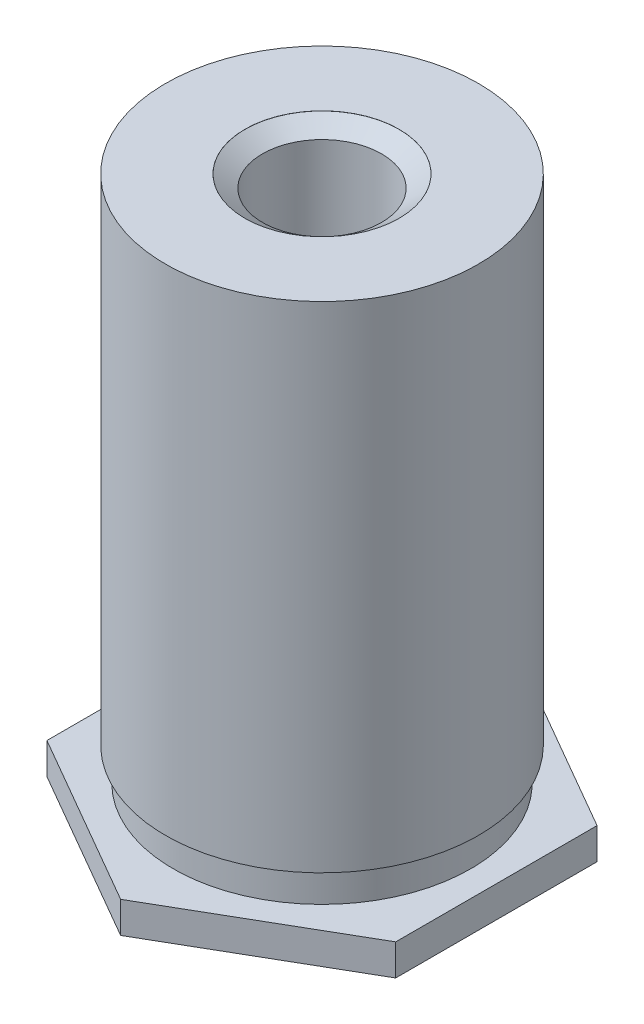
ISO-10303-21;
HEADER;
FILE_DESCRIPTION(('STEP AP214'),'2;1');
FILE_NAME('part.step','',(''),(''),'','','');
FILE_SCHEMA(('AUTOMOTIVE_DESIGN { 1 0 10303 214 1 1 1 1 }'));
ENDSEC;
DATA;
#1=APPLICATION_CONTEXT('core data for automotive mechanical design processes');
#2=APPLICATION_PROTOCOL_DEFINITION('international standard','automotive_design',2000,#1);
#3=PRODUCT_CONTEXT('',#1,'mechanical');
#4=PRODUCT('Part','Part','',(#3));
#5=PRODUCT_RELATED_PRODUCT_CATEGORY('part','',(#4));
#6=PRODUCT_DEFINITION_FORMATION('','',#4);
#7=PRODUCT_DEFINITION_CONTEXT('part definition',#1,'design');
#8=PRODUCT_DEFINITION('design','',#6,#7);
#9=PRODUCT_DEFINITION_SHAPE('','',#8);
#10=(LENGTH_UNIT() NAMED_UNIT(*) SI_UNIT(.MILLI.,.METRE.));
#11=(NAMED_UNIT(*) PLANE_ANGLE_UNIT() SI_UNIT($,.RADIAN.));
#12=(NAMED_UNIT(*) SI_UNIT($,.STERADIAN.) SOLID_ANGLE_UNIT());
#13=UNCERTAINTY_MEASURE_WITH_UNIT(LENGTH_MEASURE(1.E-05),#10,'distance_accuracy_value','');
#14=(GEOMETRIC_REPRESENTATION_CONTEXT(3) GLOBAL_UNCERTAINTY_ASSIGNED_CONTEXT((#13)) GLOBAL_UNIT_ASSIGNED_CONTEXT((#10,
#11,#12)) REPRESENTATION_CONTEXT('',''));
#15=CARTESIAN_POINT('',(0.,0.,0.));
#16=DIRECTION('',(0.,0.,1.));
#17=DIRECTION('',(1.,0.,0.));
#18=AXIS2_PLACEMENT_3D('',#15,#16,#17);
#19=CARTESIAN_POINT('',(4.596384,0.7112,0.));
#20=DIRECTION('',(0.,1.,0.));
#21=DIRECTION('',(0.,0.,1.));
#22=AXIS2_PLACEMENT_3D('',#19,#20,#21);
#23=PLANE('',#22);
#24=CARTESIAN_POINT('',(0.,0.7112,0.));
#25=DIRECTION('',(0.,-1.,0.));
#26=DIRECTION('',(0.,0.,-1.));
#27=AXIS2_PLACEMENT_3D('',#24,#25,#26);
#28=CIRCLE('',#27,3.3782);
#29=CARTESIAN_POINT('',(0.,0.7112,-3.3782));
#30=VERTEX_POINT('',#29);
#31=EDGE_CURVE('E11',#30,#30,#28,.T.);
#32=ORIENTED_EDGE('',*,*,#31,.T.);
#33=EDGE_LOOP('',(#32));
#34=FACE_BOUND('',#33,.T.);
#35=DIRECTION('',(0.866025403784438,0.,0.5));
#36=VECTOR('',#35,1.);
#37=CARTESIAN_POINT('',(0.,0.7112,4.57538541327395));
#38=LINE('',#37,#36);
#39=CARTESIAN_POINT('',(-3.9624,0.7112,2.28769270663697));
#40=VERTEX_POINT('',#39);
#41=CARTESIAN_POINT('',(0.,0.7112,4.57538541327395));
#42=VERTEX_POINT('',#41);
#43=EDGE_CURVE('E130',#40,#42,#38,.T.);
#44=ORIENTED_EDGE('',*,*,#43,.T.);
#45=DIRECTION('',(0.866025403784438,0.,-0.5));
#46=VECTOR('',#45,1.);
#47=CARTESIAN_POINT('',(3.9624,0.7112,2.28769270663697));
#48=LINE('',#47,#46);
#49=CARTESIAN_POINT('',(3.9624,0.7112,2.28769270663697));
#50=VERTEX_POINT('',#49);
#51=EDGE_CURVE('E119',#42,#50,#48,.T.);
#52=ORIENTED_EDGE('',*,*,#51,.T.);
#53=DIRECTION('',(0.,0.,-1.));
#54=VECTOR('',#53,1.);
#55=CARTESIAN_POINT('',(3.9624,0.7112,-2.28769270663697));
#56=LINE('',#55,#54);
#57=CARTESIAN_POINT('',(3.9624,0.7112,-2.28769270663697));
#58=VERTEX_POINT('',#57);
#59=EDGE_CURVE('E122',#50,#58,#56,.T.);
#60=ORIENTED_EDGE('',*,*,#59,.T.);
#61=DIRECTION('',(-0.866025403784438,0.,-0.5));
#62=VECTOR('',#61,1.);
#63=CARTESIAN_POINT('',(0.,0.7112,-4.57538541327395));
#64=LINE('',#63,#62);
#65=CARTESIAN_POINT('',(0.,0.7112,-4.57538541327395));
#66=VERTEX_POINT('',#65);
#67=EDGE_CURVE('E47',#58,#66,#64,.T.);
#68=ORIENTED_EDGE('',*,*,#67,.T.);
#69=DIRECTION('',(-0.866025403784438,0.,0.5));
#70=VECTOR('',#69,1.);
#71=CARTESIAN_POINT('',(-3.9624,0.7112,-2.28769270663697));
#72=LINE('',#71,#70);
#73=CARTESIAN_POINT('',(-3.9624,0.7112,-2.28769270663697));
#74=VERTEX_POINT('',#73);
#75=EDGE_CURVE('E95',#66,#74,#72,.T.);
#76=ORIENTED_EDGE('',*,*,#75,.T.);
#77=DIRECTION('',(0.,0.,1.));
#78=VECTOR('',#77,1.);
#79=CARTESIAN_POINT('',(-3.9624,0.7112,2.28769270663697));
#80=LINE('',#79,#78);
#81=EDGE_CURVE('E127',#74,#40,#80,.T.);
#82=ORIENTED_EDGE('',*,*,#81,.T.);
#83=EDGE_LOOP('',(#44,#52,#60,#68,#76,#82));
#84=FACE_BOUND('',#83,.T.);
#85=ADVANCED_FACE('F32',(#34,#84),#23,.T.);
#86=CARTESIAN_POINT('',(0.,0.,0.));
#87=DIRECTION('',(0.,-1.,0.));
#88=DIRECTION('',(0.,0.,-1.));
#89=AXIS2_PLACEMENT_3D('',#86,#87,#88);
#90=CYLINDRICAL_SURFACE('',#89,3.3782);
#91=CARTESIAN_POINT('',(0.,1.45796,0.));
#92=DIRECTION('',(0.,-1.,0.));
#93=DIRECTION('',(0.,0.,-1.));
#94=AXIS2_PLACEMENT_3D('',#91,#92,#93);
#95=CIRCLE('',#94,3.3782);
#96=CARTESIAN_POINT('',(0.,1.45796,-3.3782));
#97=VERTEX_POINT('',#96);
#98=EDGE_CURVE('E40',#97,#97,#95,.T.);
#99=ORIENTED_EDGE('',*,*,#98,.T.);
#100=EDGE_LOOP('',(#99));
#101=FACE_BOUND('',#100,.T.);
#102=ORIENTED_EDGE('',*,*,#31,.F.);
#103=EDGE_LOOP('',(#102));
#104=FACE_BOUND('',#103,.T.);
#105=ADVANCED_FACE('F164',(#101,#104),#90,.T.);
#106=CARTESIAN_POINT('',(3.556,1.45796,0.));
#107=DIRECTION('',(0.,-1.,0.));
#108=DIRECTION('',(0.,0.,-1.));
#109=AXIS2_PLACEMENT_3D('',#106,#107,#108);
#110=PLANE('',#109);
#111=CARTESIAN_POINT('',(0.,1.45796,0.));
#112=DIRECTION('',(0.,-1.,0.));
#113=DIRECTION('',(0.,0.,-1.));
#114=AXIS2_PLACEMENT_3D('',#111,#112,#113);
#115=CIRCLE('',#114,3.556);
#116=CARTESIAN_POINT('',(0.,1.45796,-3.556));
#117=VERTEX_POINT('',#116);
#118=EDGE_CURVE('E158',#117,#117,#115,.T.);
#119=ORIENTED_EDGE('',*,*,#118,.T.);
#120=EDGE_LOOP('',(#119));
#121=FACE_BOUND('',#120,.T.);
#122=ORIENTED_EDGE('',*,*,#98,.F.);
#123=EDGE_LOOP('',(#122));
#124=FACE_BOUND('',#123,.T.);
#125=ADVANCED_FACE('F167',(#121,#124),#110,.T.);
#126=CARTESIAN_POINT('',(0.,0.,0.));
#127=DIRECTION('',(0.,-1.,0.));
#128=DIRECTION('',(0.,0.,-1.));
#129=AXIS2_PLACEMENT_3D('',#126,#127,#128);
#130=CYLINDRICAL_SURFACE('',#129,3.556);
#131=CARTESIAN_POINT('',(0.,12.7,0.));
#132=DIRECTION('',(0.,-1.,0.));
#133=DIRECTION('',(0.,0.,-1.));
#134=AXIS2_PLACEMENT_3D('',#131,#132,#133);
#135=CIRCLE('',#134,3.556);
#136=CARTESIAN_POINT('',(0.,12.7,-3.556));
#137=VERTEX_POINT('',#136);
#138=EDGE_CURVE('E155',#137,#137,#135,.T.);
#139=ORIENTED_EDGE('',*,*,#138,.T.);
#140=EDGE_LOOP('',(#139));
#141=FACE_BOUND('',#140,.T.);
#142=ORIENTED_EDGE('',*,*,#118,.F.);
#143=EDGE_LOOP('',(#142));
#144=FACE_BOUND('',#143,.T.);
#145=ADVANCED_FACE('F169',(#141,#144),#130,.T.);
#146=CARTESIAN_POINT('',(3.556,12.7,0.));
#147=DIRECTION('',(0.,1.,0.));
#148=DIRECTION('',(0.,0.,1.));
#149=AXIS2_PLACEMENT_3D('',#146,#147,#148);
#150=PLANE('',#149);
#151=CARTESIAN_POINT('',(0.,12.7,0.));
#152=DIRECTION('',(0.,1.,0.));
#153=DIRECTION('',(0.,0.,1.));
#154=AXIS2_PLACEMENT_3D('',#151,#152,#153);
#155=CIRCLE('',#154,1.7526);
#156=CARTESIAN_POINT('',(0.,12.7,1.7526));
#157=VERTEX_POINT('',#156);
#158=EDGE_CURVE('E35',#157,#157,#155,.T.);
#159=ORIENTED_EDGE('',*,*,#158,.F.);
#160=EDGE_LOOP('',(#159));
#161=FACE_BOUND('',#160,.T.);
#162=ORIENTED_EDGE('',*,*,#138,.F.);
#163=EDGE_LOOP('',(#162));
#164=FACE_BOUND('',#163,.T.);
#165=ADVANCED_FACE('F176',(#161,#164),#150,.T.);
#166=CARTESIAN_POINT('',(0.,-2.54,0.));
#167=DIRECTION('',(0.,-1.,0.));
#168=DIRECTION('',(0.,0.,-1.));
#169=AXIS2_PLACEMENT_3D('',#166,#167,#168);
#170=CYLINDRICAL_SURFACE('',#169,1.7526);
#171=ORIENTED_EDGE('',*,*,#158,.T.);
#172=EDGE_LOOP('',(#171));
#173=FACE_BOUND('',#172,.T.);
#174=CARTESIAN_POINT('',(0.,12.69746,0.));
#175=DIRECTION('',(0.,-1.,0.));
#176=DIRECTION('',(0.,0.,-1.));
#177=AXIS2_PLACEMENT_3D('',#174,#175,#176);
#178=CIRCLE('',#177,1.7526);
#179=CARTESIAN_POINT('',(0.,12.69746,-1.7526));
#180=VERTEX_POINT('',#179);
#181=EDGE_CURVE('E135',#180,#180,#178,.T.);
#182=ORIENTED_EDGE('',*,*,#181,.T.);
#183=EDGE_LOOP('',(#182));
#184=FACE_BOUND('',#183,.T.);
#185=ADVANCED_FACE('F215',(#173,#184),#170,.F.);
#186=CARTESIAN_POINT('',(0.,12.4174460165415,0.));
#187=DIRECTION('',(0.,1.,0.));
#188=DIRECTION('',(0.,0.,1.));
#189=AXIS2_PLACEMENT_3D('',#186,#187,#188);
#190=CONICAL_SURFACE('',#189,1.35255,0.960105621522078);
#191=ORIENTED_EDGE('',*,*,#181,.F.);
#192=EDGE_LOOP('',(#191));
#193=FACE_BOUND('',#192,.T.);
#194=CARTESIAN_POINT('',(0.,12.4174460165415,0.));
#195=DIRECTION('',(0.,-1.,0.));
#196=DIRECTION('',(0.,0.,-1.));
#197=AXIS2_PLACEMENT_3D('',#194,#195,#196);
#198=CIRCLE('',#197,1.35255);
#199=CARTESIAN_POINT('',(0.,12.4174460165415,-1.35255));
#200=VERTEX_POINT('',#199);
#201=EDGE_CURVE('E143',#200,#200,#198,.T.);
#202=ORIENTED_EDGE('',*,*,#201,.T.);
#203=EDGE_LOOP('',(#202));
#204=FACE_BOUND('',#203,.T.);
#205=ADVANCED_FACE('F211',(#193,#204),#190,.F.);
#206=CARTESIAN_POINT('',(0.,1.82735544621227,0.));
#207=DIRECTION('',(0.,1.,0.));
#208=DIRECTION('',(0.,0.,1.));
#209=AXIS2_PLACEMENT_3D('',#206,#207,#208);
#210=CONICAL_SURFACE('',#209,0.,1.17809724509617);
#211=CARTESIAN_POINT('',(0.,2.3876,0.));
#212=DIRECTION('',(0.,-1.,0.));
#213=DIRECTION('',(0.,0.,-1.));
#214=AXIS2_PLACEMENT_3D('',#211,#212,#213);
#215=CIRCLE('',#214,1.35255);
#216=CARTESIAN_POINT('',(0.,2.3876,-1.35255));
#217=VERTEX_POINT('',#216);
#218=EDGE_CURVE('E146',#217,#217,#215,.T.);
#219=ORIENTED_EDGE('',*,*,#218,.F.);
#220=EDGE_LOOP('',(#219));
#221=FACE_BOUND('',#220,.T.);
#222=CARTESIAN_POINT('',(0.,1.82735544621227,0.));
#223=VERTEX_POINT('',#222);
#224=VERTEX_LOOP('',#223);
#225=FACE_BOUND('',#224,.T.);
#226=ADVANCED_FACE('F214',(#221,#225),#210,.F.);
#227=CARTESIAN_POINT('',(0.,0.,0.));
#228=DIRECTION('',(0.,-1.,0.));
#229=DIRECTION('',(0.,0.,-1.));
#230=AXIS2_PLACEMENT_3D('',#227,#228,#229);
#231=CYLINDRICAL_SURFACE('',#230,1.35255);
#232=ORIENTED_EDGE('',*,*,#201,.F.);
#233=EDGE_LOOP('',(#232));
#234=FACE_BOUND('',#233,.T.);
#235=ORIENTED_EDGE('',*,*,#218,.T.);
#236=EDGE_LOOP('',(#235));
#237=FACE_BOUND('',#236,.T.);
#238=ADVANCED_FACE('F210',(#234,#237),#231,.F.);
#239=CARTESIAN_POINT('',(3.9624,0.,2.28769270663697));
#240=DIRECTION('',(0.5,0.,0.866025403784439));
#241=DIRECTION('',(0.866025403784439,0.,-0.5));
#242=AXIS2_PLACEMENT_3D('',#239,#240,#241);
#243=PLANE('',#242);
#244=ORIENTED_EDGE('',*,*,#51,.F.);
#245=DIRECTION('',(0.,1.,0.));
#246=VECTOR('',#245,1.);
#247=CARTESIAN_POINT('',(0.,0.,4.57538541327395));
#248=LINE('',#247,#246);
#249=CARTESIAN_POINT('',(0.,0.,4.57538541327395));
#250=VERTEX_POINT('',#249);
#251=EDGE_CURVE('E133',#250,#42,#248,.T.);
#252=ORIENTED_EDGE('',*,*,#251,.F.);
#253=DIRECTION('',(0.866025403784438,0.,-0.5));
#254=VECTOR('',#253,1.);
#255=CARTESIAN_POINT('',(3.9624,0.,2.28769270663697));
#256=LINE('',#255,#254);
#257=CARTESIAN_POINT('',(3.9624,0.,2.28769270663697));
#258=VERTEX_POINT('',#257);
#259=EDGE_CURVE('E55',#250,#258,#256,.T.);
#260=ORIENTED_EDGE('',*,*,#259,.T.);
#261=DIRECTION('',(0.,1.,0.));
#262=VECTOR('',#261,1.);
#263=CARTESIAN_POINT('',(3.9624,0.,2.28769270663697));
#264=LINE('',#263,#262);
#265=EDGE_CURVE('E118',#258,#50,#264,.T.);
#266=ORIENTED_EDGE('',*,*,#265,.T.);
#267=EDGE_LOOP('',(#244,#252,#260,#266));
#268=FACE_BOUND('',#267,.T.);
#269=ADVANCED_FACE('F190',(#268),#243,.T.);
#270=CARTESIAN_POINT('',(0.,0.,4.57538541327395));
#271=DIRECTION('',(-0.5,0.,0.866025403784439));
#272=DIRECTION('',(0.866025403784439,0.,0.5));
#273=AXIS2_PLACEMENT_3D('',#270,#271,#272);
#274=PLANE('',#273);
#275=ORIENTED_EDGE('',*,*,#43,.F.);
#276=DIRECTION('',(0.,1.,0.));
#277=VECTOR('',#276,1.);
#278=CARTESIAN_POINT('',(-3.9624,0.,2.28769270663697));
#279=LINE('',#278,#277);
#280=CARTESIAN_POINT('',(-3.9624,0.,2.28769270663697));
#281=VERTEX_POINT('',#280);
#282=EDGE_CURVE('E136',#281,#40,#279,.T.);
#283=ORIENTED_EDGE('',*,*,#282,.F.);
#284=DIRECTION('',(0.866025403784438,0.,0.5));
#285=VECTOR('',#284,1.);
#286=CARTESIAN_POINT('',(0.,0.,4.57538541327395));
#287=LINE('',#286,#285);
#288=EDGE_CURVE('E112',#281,#250,#287,.T.);
#289=ORIENTED_EDGE('',*,*,#288,.T.);
#290=ORIENTED_EDGE('',*,*,#251,.T.);
#291=EDGE_LOOP('',(#275,#283,#289,#290));
#292=FACE_BOUND('',#291,.T.);
#293=ADVANCED_FACE('F189',(#292),#274,.T.);
#294=CARTESIAN_POINT('',(-3.9624,0.,2.28769270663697));
#295=DIRECTION('',(-1.,0.,0.));
#296=DIRECTION('',(0.,0.,1.));
#297=AXIS2_PLACEMENT_3D('',#294,#295,#296);
#298=PLANE('',#297);
#299=ORIENTED_EDGE('',*,*,#81,.F.);
#300=DIRECTION('',(0.,1.,0.));
#301=VECTOR('',#300,1.);
#302=CARTESIAN_POINT('',(-3.9624,0.,-2.28769270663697));
#303=LINE('',#302,#301);
#304=CARTESIAN_POINT('',(-3.9624,0.,-2.28769270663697));
#305=VERTEX_POINT('',#304);
#306=EDGE_CURVE('E96',#305,#74,#303,.T.);
#307=ORIENTED_EDGE('',*,*,#306,.F.);
#308=DIRECTION('',(0.,0.,1.));
#309=VECTOR('',#308,1.);
#310=CARTESIAN_POINT('',(-3.9624,0.,2.28769270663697));
#311=LINE('',#310,#309);
#312=EDGE_CURVE('E110',#305,#281,#311,.T.);
#313=ORIENTED_EDGE('',*,*,#312,.T.);
#314=ORIENTED_EDGE('',*,*,#282,.T.);
#315=EDGE_LOOP('',(#299,#307,#313,#314));
#316=FACE_BOUND('',#315,.T.);
#317=ADVANCED_FACE('F278',(#316),#298,.T.);
#318=CARTESIAN_POINT('',(-3.9624,0.,-2.28769270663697));
#319=DIRECTION('',(-0.5,0.,-0.866025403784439));
#320=DIRECTION('',(-0.866025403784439,0.,0.5));
#321=AXIS2_PLACEMENT_3D('',#318,#319,#320);
#322=PLANE('',#321);
#323=ORIENTED_EDGE('',*,*,#75,.F.);
#324=DIRECTION('',(0.,1.,0.));
#325=VECTOR('',#324,1.);
#326=CARTESIAN_POINT('',(0.,0.,-4.57538541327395));
#327=LINE('',#326,#325);
#328=CARTESIAN_POINT('',(0.,0.,-4.57538541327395));
#329=VERTEX_POINT('',#328);
#330=EDGE_CURVE('E88',#329,#66,#327,.T.);
#331=ORIENTED_EDGE('',*,*,#330,.F.);
#332=DIRECTION('',(-0.866025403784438,0.,0.5));
#333=VECTOR('',#332,1.);
#334=CARTESIAN_POINT('',(-3.9624,0.,-2.28769270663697));
#335=LINE('',#334,#333);
#336=EDGE_CURVE('E92',#329,#305,#335,.T.);
#337=ORIENTED_EDGE('',*,*,#336,.T.);
#338=ORIENTED_EDGE('',*,*,#306,.T.);
#339=EDGE_LOOP('',(#323,#331,#337,#338));
#340=FACE_BOUND('',#339,.T.);
#341=ADVANCED_FACE('F90',(#340),#322,.T.);
#342=CARTESIAN_POINT('',(0.,0.,-4.57538541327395));
#343=DIRECTION('',(0.5,0.,-0.866025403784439));
#344=DIRECTION('',(-0.866025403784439,0.,-0.5));
#345=AXIS2_PLACEMENT_3D('',#342,#343,#344);
#346=PLANE('',#345);
#347=ORIENTED_EDGE('',*,*,#67,.F.);
#348=DIRECTION('',(0.,1.,0.));
#349=VECTOR('',#348,1.);
#350=CARTESIAN_POINT('',(3.9624,0.,-2.28769270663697));
#351=LINE('',#350,#349);
#352=CARTESIAN_POINT('',(3.9624,0.,-2.28769270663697));
#353=VERTEX_POINT('',#352);
#354=EDGE_CURVE('E97',#353,#58,#351,.T.);
#355=ORIENTED_EDGE('',*,*,#354,.F.);
#356=DIRECTION('',(-0.866025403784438,0.,-0.5));
#357=VECTOR('',#356,1.);
#358=CARTESIAN_POINT('',(0.,0.,-4.57538541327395));
#359=LINE('',#358,#357);
#360=EDGE_CURVE('E100',#353,#329,#359,.T.);
#361=ORIENTED_EDGE('',*,*,#360,.T.);
#362=ORIENTED_EDGE('',*,*,#330,.T.);
#363=EDGE_LOOP('',(#347,#355,#361,#362));
#364=FACE_BOUND('',#363,.T.);
#365=ADVANCED_FACE('F101',(#364),#346,.T.);
#366=CARTESIAN_POINT('',(3.9624,0.,-2.28769270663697));
#367=DIRECTION('',(1.,0.,0.));
#368=DIRECTION('',(0.,0.,-1.));
#369=AXIS2_PLACEMENT_3D('',#366,#367,#368);
#370=PLANE('',#369);
#371=ORIENTED_EDGE('',*,*,#59,.F.);
#372=ORIENTED_EDGE('',*,*,#265,.F.);
#373=DIRECTION('',(0.,0.,-1.));
#374=VECTOR('',#373,1.);
#375=CARTESIAN_POINT('',(3.9624,0.,-2.28769270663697));
#376=LINE('',#375,#374);
#377=EDGE_CURVE('E105',#258,#353,#376,.T.);
#378=ORIENTED_EDGE('',*,*,#377,.T.);
#379=ORIENTED_EDGE('',*,*,#354,.T.);
#380=EDGE_LOOP('',(#371,#372,#378,#379));
#381=FACE_BOUND('',#380,.T.);
#382=ADVANCED_FACE('F193',(#381),#370,.T.);
#383=CARTESIAN_POINT('',(3.556,0.00253999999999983,0.));
#384=DIRECTION('',(0.,-1.,0.));
#385=DIRECTION('',(0.,0.,-1.));
#386=AXIS2_PLACEMENT_3D('',#383,#384,#385);
#387=PLANE('',#386);
#388=CARTESIAN_POINT('',(0.,0.00254000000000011,0.));
#389=DIRECTION('',(0.,-1.,0.));
#390=DIRECTION('',(0.,0.,-1.));
#391=AXIS2_PLACEMENT_3D('',#388,#389,#390);
#392=CIRCLE('',#391,3.556);
#393=CARTESIAN_POINT('',(0.,0.00254000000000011,-3.556));
#394=VERTEX_POINT('',#393);
#395=EDGE_CURVE('E152',#394,#394,#392,.T.);
#396=ORIENTED_EDGE('',*,*,#395,.T.);
#397=EDGE_LOOP('',(#396));
#398=FACE_BOUND('',#397,.T.);
#399=ADVANCED_FACE('F196',(#398),#387,.T.);
#400=CARTESIAN_POINT('',(0.,0.,0.));
#401=DIRECTION('',(0.,-1.,0.));
#402=DIRECTION('',(0.,0.,-1.));
#403=AXIS2_PLACEMENT_3D('',#400,#401,#402);
#404=CYLINDRICAL_SURFACE('',#403,3.556);
#405=CARTESIAN_POINT('',(0.,0.,0.));
#406=DIRECTION('',(0.,-1.,0.));
#407=DIRECTION('',(0.,0.,-1.));
#408=AXIS2_PLACEMENT_3D('',#405,#406,#407);
#409=CIRCLE('',#408,3.556);
#410=CARTESIAN_POINT('',(0.,0.,-3.556));
#411=VERTEX_POINT('',#410);
#412=EDGE_CURVE('E149',#411,#411,#409,.T.);
#413=ORIENTED_EDGE('',*,*,#412,.T.);
#414=EDGE_LOOP('',(#413));
#415=FACE_BOUND('',#414,.T.);
#416=ORIENTED_EDGE('',*,*,#395,.F.);
#417=EDGE_LOOP('',(#416));
#418=FACE_BOUND('',#417,.T.);
#419=ADVANCED_FACE('F202',(#415,#418),#404,.F.);
#420=CARTESIAN_POINT('',(3.556,0.,0.));
#421=DIRECTION('',(0.,-1.,0.));
#422=DIRECTION('',(0.,0.,-1.));
#423=AXIS2_PLACEMENT_3D('',#420,#421,#422);
#424=PLANE('',#423);
#425=ORIENTED_EDGE('',*,*,#412,.F.);
#426=EDGE_LOOP('',(#425));
#427=FACE_BOUND('',#426,.T.);
#428=ORIENTED_EDGE('',*,*,#377,.F.);
#429=ORIENTED_EDGE('',*,*,#259,.F.);
#430=ORIENTED_EDGE('',*,*,#288,.F.);
#431=ORIENTED_EDGE('',*,*,#312,.F.);
#432=ORIENTED_EDGE('',*,*,#336,.F.);
#433=ORIENTED_EDGE('',*,*,#360,.F.);
#434=EDGE_LOOP('',(#428,#429,#430,#431,#432,#433));
#435=FACE_BOUND('',#434,.T.);
#436=ADVANCED_FACE('F107',(#427,#435),#424,.T.);
#437=CLOSED_SHELL('',(#85,#105,#125,#145,#165,#185,#205,#226,#238,#269,#293,#317,#341,#365,#382,
#399,#419,#436));
#438=MANIFOLD_SOLID_BREP('B2',#437);
#439=ADVANCED_BREP_SHAPE_REPRESENTATION('',(#18,#438),#14);
#440=SHAPE_DEFINITION_REPRESENTATION(#9,#439);
ENDSEC;
END-ISO-10303-21;
